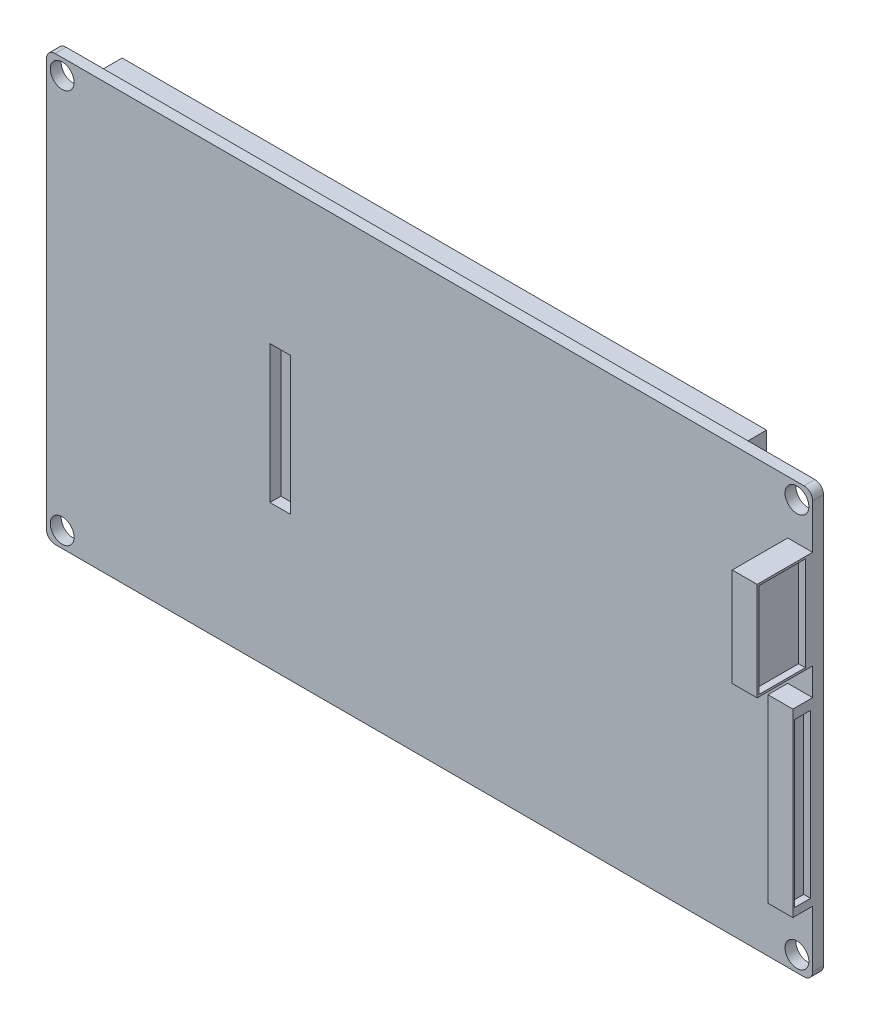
from build123d import *

# Parameters (mm, degrees)
SKETCH_1_W          = 112.42
SKETCH_1_H          = 62.4
SKETCH_1_R          = 1.75
SKETCH_1_W_2        = 3
SKETCH_1_H_2        = 20.199999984
EXTRUDE_1_DEPTH     = 1.6
FILLET_1_R          = 1.27
SKETCH_1_4_W        = 3.651751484
SKETCH_1_4_H        = 14.43
EXTRUDE_2_DEPTH     = 9.74
SKETCH_1_5_W        = 3.651751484
SKETCH_1_5_H        = 26.5
EXTRUDE_3_DEPTH     = 4.5
SKETCH_1_6_W        = 83.52
SKETCH_1_6_H        = 55.68
EXTRUDE_4_DEPTH     = 3.51
SKETCH_1_7_W        = 83.52
SKETCH_1_7_H        = 55.68
EXTRUDE_5_DEPTH     = 3.5
SKETCH_2_W          = 2.34
SKETCH_2_H          = 23.89
SKETCH_2_W_2        = 6.78
SKETCH_2_H_2        = 13.83
CUT_EXTRUDE_4_DEPTH = 1


with BuildPart() as part:
    # Sketch 1 → Extrude 1 (new body)
    with BuildSketch(Plane.XY):
        with Locations((-56.21, 31.2)):
            Rectangle(SKETCH_1_W, SKETCH_1_H)
        with Locations((-110.12, 60.1)):
            Circle(SKETCH_1_R, mode=Mode.SUBTRACT)
        with Locations((-110.12, 2.3)):
            Circle(SKETCH_1_R, mode=Mode.SUBTRACT)
        with Locations((-2.3, 2.3)):
            Circle(SKETCH_1_R, mode=Mode.SUBTRACT)
        with Locations((-2.3, 60.1)):
            Circle(SKETCH_1_R, mode=Mode.SUBTRACT)
        with Locations((-78.13, 31.2)):
            Rectangle(SKETCH_1_W_2, SKETCH_1_H_2, mode=Mode.SUBTRACT)
    extrude(amount=EXTRUDE_1_DEPTH)

    # Fillet 1
    fillet_1_edges = [part.edges().sort_by_distance(p)[0] for p in [
        (-112.42, 0, 0.8),
        (-112.42, 62.4, 0.8),
        (0, 62.4, 0.8),
        (0, 0, 0.8),
    ]]
    fillet(fillet_1_edges, radius=FILLET_1_R)

    # Sketch 1_4 → Extrude 2 (add)
    with BuildSketch(Plane.XY):
        with Locations((-1.825875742, 47.365)):
            Rectangle(SKETCH_1_4_W, SKETCH_1_4_H)
    extrude(amount=EXTRUDE_2_DEPTH)

    # Sketch 1_5 → Extrude 3 (add)
    with BuildSketch(Plane.XY):
        with Locations((-1.825875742, 22.861)):
            Rectangle(SKETCH_1_5_W, SKETCH_1_5_H)
    extrude(amount=EXTRUDE_3_DEPTH)

    # Sketch 1_6 → Extrude 4 (add)
    with BuildSketch(Plane.XY):
        with Locations((-56.21, 31.2)):
            Rectangle(SKETCH_1_6_W, SKETCH_1_6_H)
    extrude(amount=-EXTRUDE_4_DEPTH)

    # Sketch 1_7 → Extrude 5 (add)
    with BuildSketch(Plane.XY):
        Polygon((-106.42, 61.64), (-106.42, 0.76), (-94.85, 0.76), (-88.85, 0.76), (-56.95, 0.76), (-50.95, 0.76), (-11.85, 0.76), (-11.85, 61.64), (-12.05, 61.64), (-18.05, 61.64), (-50.95, 61.64), (-56.95, 61.64), (-88.85, 61.64), (-94.85, 61.64), align=None)
        with Locations((-56.21, 31.2)):
            Rectangle(SKETCH_1_7_W, SKETCH_1_7_H, mode=Mode.SUBTRACT)
    extrude(amount=-EXTRUDE_5_DEPTH)

    # Sketch 2 → Cut-Extrude 4 (cut)
    with BuildSketch(Plane(origin=(0, 0, 0), x_dir=(0, 0, -1), z_dir=(1, 0, 0))):
        with Locations((-3.07, 22.706)):
            Rectangle(SKETCH_2_W, SKETCH_2_H)
        with Locations((-6.05, 47.365)):
            Rectangle(SKETCH_2_W_2, SKETCH_2_H_2)
    extrude(amount=-CUT_EXTRUDE_4_DEPTH, mode=Mode.SUBTRACT)


solid = part.part
